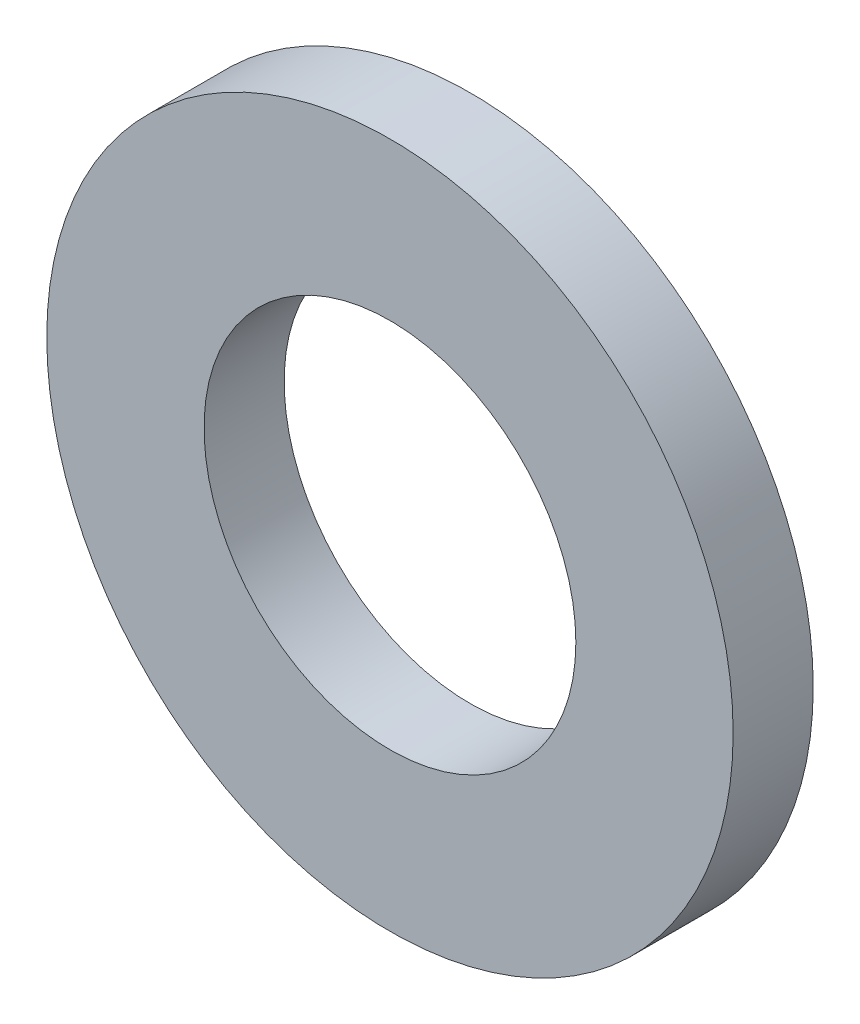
ISO-10303-21;
HEADER;
FILE_DESCRIPTION(('STEP AP214'),'2;1');
FILE_NAME('part.step','',(''),(''),'','','');
FILE_SCHEMA(('AUTOMOTIVE_DESIGN { 1 0 10303 214 1 1 1 1 }'));
ENDSEC;
DATA;
#1=APPLICATION_CONTEXT('core data for automotive mechanical design processes');
#2=APPLICATION_PROTOCOL_DEFINITION('international standard','automotive_design',2000,#1);
#3=PRODUCT_CONTEXT('',#1,'mechanical');
#4=PRODUCT('Part','Part','',(#3));
#5=PRODUCT_RELATED_PRODUCT_CATEGORY('part','',(#4));
#6=PRODUCT_DEFINITION_FORMATION('','',#4);
#7=PRODUCT_DEFINITION_CONTEXT('part definition',#1,'design');
#8=PRODUCT_DEFINITION('design','',#6,#7);
#9=PRODUCT_DEFINITION_SHAPE('','',#8);
#10=(LENGTH_UNIT() NAMED_UNIT(*) SI_UNIT(.MILLI.,.METRE.));
#11=(NAMED_UNIT(*) PLANE_ANGLE_UNIT() SI_UNIT($,.RADIAN.));
#12=(NAMED_UNIT(*) SI_UNIT($,.STERADIAN.) SOLID_ANGLE_UNIT());
#13=UNCERTAINTY_MEASURE_WITH_UNIT(LENGTH_MEASURE(1.E-05),#10,'distance_accuracy_value','');
#14=(GEOMETRIC_REPRESENTATION_CONTEXT(3) GLOBAL_UNCERTAINTY_ASSIGNED_CONTEXT((#13)) GLOBAL_UNIT_ASSIGNED_CONTEXT((#10,
#11,#12)) REPRESENTATION_CONTEXT('',''));
#15=CARTESIAN_POINT('',(0.,0.,0.));
#16=DIRECTION('',(0.,0.,1.));
#17=DIRECTION('',(1.,0.,0.));
#18=AXIS2_PLACEMENT_3D('',#15,#16,#17);
#19=CARTESIAN_POINT('',(0.,0.,1.4));
#20=DIRECTION('',(0.,0.,1.));
#21=DIRECTION('',(1.,0.,0.));
#22=AXIS2_PLACEMENT_3D('',#19,#20,#21);
#23=PLANE('',#22);
#24=CARTESIAN_POINT('',(0.,0.,1.4));
#25=DIRECTION('',(0.,0.,1.));
#26=DIRECTION('',(1.,0.,0.));
#27=AXIS2_PLACEMENT_3D('',#24,#25,#26);
#28=CIRCLE('',#27,6.);
#29=CARTESIAN_POINT('',(6.,0.,1.4));
#30=VERTEX_POINT('',#29);
#31=EDGE_CURVE('E10',#30,#30,#28,.T.);
#32=ORIENTED_EDGE('',*,*,#31,.T.);
#33=EDGE_LOOP('',(#32));
#34=FACE_BOUND('',#33,.T.);
#35=CARTESIAN_POINT('',(0.,0.,1.4));
#36=DIRECTION('',(0.,0.,1.));
#37=DIRECTION('',(1.,0.,0.));
#38=AXIS2_PLACEMENT_3D('',#35,#36,#37);
#39=CIRCLE('',#38,3.25);
#40=CARTESIAN_POINT('',(3.25,0.,1.4));
#41=VERTEX_POINT('',#40);
#42=EDGE_CURVE('E40',#41,#41,#39,.T.);
#43=ORIENTED_EDGE('',*,*,#42,.F.);
#44=EDGE_LOOP('',(#43));
#45=FACE_BOUND('',#44,.T.);
#46=ADVANCED_FACE('F29',(#34,#45),#23,.T.);
#47=CARTESIAN_POINT('',(0.,0.,0.));
#48=DIRECTION('',(0.,0.,1.));
#49=DIRECTION('',(1.,0.,0.));
#50=AXIS2_PLACEMENT_3D('',#47,#48,#49);
#51=PLANE('',#50);
#52=CARTESIAN_POINT('',(0.,0.,0.));
#53=DIRECTION('',(0.,0.,1.));
#54=DIRECTION('',(1.,0.,0.));
#55=AXIS2_PLACEMENT_3D('',#52,#53,#54);
#56=CIRCLE('',#55,6.);
#57=CARTESIAN_POINT('',(6.,0.,0.));
#58=VERTEX_POINT('',#57);
#59=EDGE_CURVE('E33',#58,#58,#56,.T.);
#60=ORIENTED_EDGE('',*,*,#59,.F.);
#61=EDGE_LOOP('',(#60));
#62=FACE_BOUND('',#61,.T.);
#63=CARTESIAN_POINT('',(0.,0.,0.));
#64=DIRECTION('',(0.,0.,1.));
#65=DIRECTION('',(1.,0.,0.));
#66=AXIS2_PLACEMENT_3D('',#63,#64,#65);
#67=CIRCLE('',#66,3.25);
#68=CARTESIAN_POINT('',(3.25,0.,0.));
#69=VERTEX_POINT('',#68);
#70=EDGE_CURVE('E42',#69,#69,#67,.T.);
#71=ORIENTED_EDGE('',*,*,#70,.T.);
#72=EDGE_LOOP('',(#71));
#73=FACE_BOUND('',#72,.T.);
#74=ADVANCED_FACE('F52',(#62,#73),#51,.F.);
#75=CARTESIAN_POINT('',(0.,0.,1.4));
#76=DIRECTION('',(0.,0.,-1.));
#77=DIRECTION('',(-1.,0.,0.));
#78=AXIS2_PLACEMENT_3D('',#75,#76,#77);
#79=CYLINDRICAL_SURFACE('',#78,6.);
#80=ORIENTED_EDGE('',*,*,#31,.F.);
#81=EDGE_LOOP('',(#80));
#82=FACE_BOUND('',#81,.T.);
#83=ORIENTED_EDGE('',*,*,#59,.T.);
#84=EDGE_LOOP('',(#83));
#85=FACE_BOUND('',#84,.T.);
#86=ADVANCED_FACE('F31',(#82,#85),#79,.T.);
#87=CARTESIAN_POINT('',(0.,0.,1.4));
#88=DIRECTION('',(0.,0.,-1.));
#89=DIRECTION('',(-1.,0.,0.));
#90=AXIS2_PLACEMENT_3D('',#87,#88,#89);
#91=CYLINDRICAL_SURFACE('',#90,3.25);
#92=ORIENTED_EDGE('',*,*,#42,.T.);
#93=EDGE_LOOP('',(#92));
#94=FACE_BOUND('',#93,.T.);
#95=ORIENTED_EDGE('',*,*,#70,.F.);
#96=EDGE_LOOP('',(#95));
#97=FACE_BOUND('',#96,.T.);
#98=ADVANCED_FACE('F48',(#94,#97),#91,.F.);
#99=CLOSED_SHELL('',(#46,#74,#86,#98));
#100=MANIFOLD_SOLID_BREP('B2',#99);
#101=ADVANCED_BREP_SHAPE_REPRESENTATION('',(#18,#100),#14);
#102=SHAPE_DEFINITION_REPRESENTATION(#9,#101);
ENDSEC;
END-ISO-10303-21;
